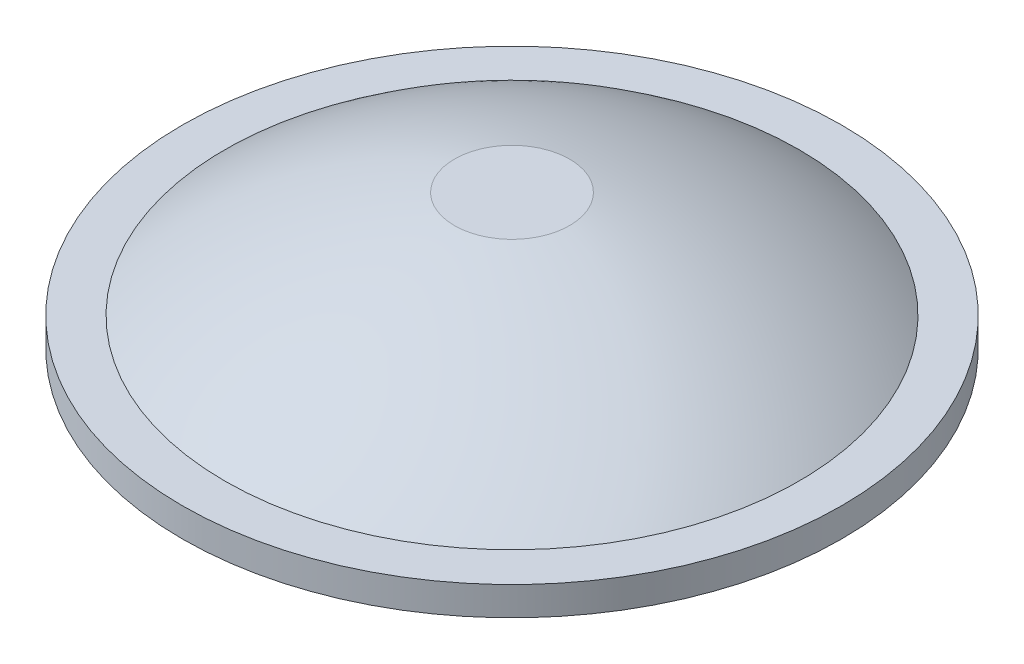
ISO-10303-21;
HEADER;
FILE_DESCRIPTION(('STEP AP214'),'2;1');
FILE_NAME('part.step','',(''),(''),'','','');
FILE_SCHEMA(('AUTOMOTIVE_DESIGN { 1 0 10303 214 1 1 1 1 }'));
ENDSEC;
DATA;
#1=APPLICATION_CONTEXT('core data for automotive mechanical design processes');
#2=APPLICATION_PROTOCOL_DEFINITION('international standard','automotive_design',2000,#1);
#3=PRODUCT_CONTEXT('',#1,'mechanical');
#4=PRODUCT('Part','Part','',(#3));
#5=PRODUCT_RELATED_PRODUCT_CATEGORY('part','',(#4));
#6=PRODUCT_DEFINITION_FORMATION('','',#4);
#7=PRODUCT_DEFINITION_CONTEXT('part definition',#1,'design');
#8=PRODUCT_DEFINITION('design','',#6,#7);
#9=PRODUCT_DEFINITION_SHAPE('','',#8);
#10=(LENGTH_UNIT() NAMED_UNIT(*) SI_UNIT(.MILLI.,.METRE.));
#11=(NAMED_UNIT(*) PLANE_ANGLE_UNIT() SI_UNIT($,.RADIAN.));
#12=(NAMED_UNIT(*) SI_UNIT($,.STERADIAN.) SOLID_ANGLE_UNIT());
#13=UNCERTAINTY_MEASURE_WITH_UNIT(LENGTH_MEASURE(1.E-05),#10,'distance_accuracy_value','');
#14=(GEOMETRIC_REPRESENTATION_CONTEXT(3) GLOBAL_UNCERTAINTY_ASSIGNED_CONTEXT((#13)) GLOBAL_UNIT_ASSIGNED_CONTEXT((#10,
#11,#12)) REPRESENTATION_CONTEXT('',''));
#15=CARTESIAN_POINT('',(0.,0.,0.));
#16=DIRECTION('',(0.,0.,1.));
#17=DIRECTION('',(1.,0.,0.));
#18=AXIS2_PLACEMENT_3D('',#15,#16,#17);
#19=CARTESIAN_POINT('',(0.,23.495,0.));
#20=DIRECTION('',(0.,-1.,0.));
#21=DIRECTION('',(0.,0.,-1.));
#22=AXIS2_PLACEMENT_3D('',#19,#20,#21);
#23=PLANE('',#22);
#24=CARTESIAN_POINT('',(0.,23.495,0.));
#25=DIRECTION('',(0.,1.,0.));
#26=DIRECTION('',(0.,0.,1.));
#27=AXIS2_PLACEMENT_3D('',#24,#25,#26);
#28=CIRCLE('',#27,12.3625899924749);
#29=CARTESIAN_POINT('',(0.,23.495,12.3625899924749));
#30=VERTEX_POINT('',#29);
#31=EDGE_CURVE('E10',#30,#30,#28,.T.);
#32=ORIENTED_EDGE('',*,*,#31,.F.);
#33=EDGE_LOOP('',(#32));
#34=FACE_BOUND('',#33,.T.);
#35=ADVANCED_FACE('F30',(#34),#23,.T.);
#36=CARTESIAN_POINT('',(0.,-96.0266034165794,0.));
#37=DIRECTION('',(0.,1.,0.));
#38=DIRECTION('',(0.,0.,1.));
#39=AXIS2_PLACEMENT_3D('',#36,#37,#38);
#40=DEGENERATE_TOROIDAL_SURFACE('',#39,13.5023620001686,122.288222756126,.F.);
#41=ORIENTED_EDGE('',*,*,#31,.T.);
#42=EDGE_LOOP('',(#41));
#43=FACE_BOUND('',#42,.T.);
#44=CARTESIAN_POINT('',(0.,0.,0.));
#45=DIRECTION('',(0.,1.,0.));
#46=DIRECTION('',(0.,0.,1.));
#47=AXIS2_PLACEMENT_3D('',#44,#45,#46);
#48=CIRCLE('',#47,62.2162015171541);
#49=CARTESIAN_POINT('',(0.,0.,62.2162015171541));
#50=VERTEX_POINT('',#49);
#51=EDGE_CURVE('E36',#50,#50,#48,.T.);
#52=ORIENTED_EDGE('',*,*,#51,.F.);
#53=EDGE_LOOP('',(#52));
#54=FACE_BOUND('',#53,.T.);
#55=ADVANCED_FACE('F91',(#43,#54),#40,.T.);
#56=CARTESIAN_POINT('',(0.,96.0266034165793,0.));
#57=DIRECTION('',(0.,1.,0.));
#58=DIRECTION('',(0.,0.,1.));
#59=AXIS2_PLACEMENT_3D('',#56,#57,#58);
#60=DEGENERATE_TOROIDAL_SURFACE('',#59,13.5023620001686,122.288222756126,.F.);
#61=ORIENTED_EDGE('',*,*,#51,.T.);
#62=EDGE_LOOP('',(#61));
#63=FACE_BOUND('',#62,.T.);
#64=CARTESIAN_POINT('',(0.,-23.495,0.));
#65=DIRECTION('',(0.,1.,0.));
#66=DIRECTION('',(0.,0.,1.));
#67=AXIS2_PLACEMENT_3D('',#64,#65,#66);
#68=CIRCLE('',#67,12.3625899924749);
#69=CARTESIAN_POINT('',(0.,-23.495,12.3625899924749));
#70=VERTEX_POINT('',#69);
#71=EDGE_CURVE('E40',#70,#70,#68,.T.);
#72=ORIENTED_EDGE('',*,*,#71,.F.);
#73=EDGE_LOOP('',(#72));
#74=FACE_BOUND('',#73,.T.);
#75=ADVANCED_FACE('F86',(#63,#74),#60,.T.);
#76=CARTESIAN_POINT('',(0.,-23.495,0.));
#77=DIRECTION('',(0.,1.,0.));
#78=DIRECTION('',(0.,0.,1.));
#79=AXIS2_PLACEMENT_3D('',#76,#77,#78);
#80=PLANE('',#79);
#81=CARTESIAN_POINT('',(0.,-23.495,0.));
#82=DIRECTION('',(0.,1.,0.));
#83=DIRECTION('',(0.,0.,1.));
#84=AXIS2_PLACEMENT_3D('',#81,#82,#83);
#85=CIRCLE('',#84,5.5499);
#86=CARTESIAN_POINT('',(0.,-23.495,5.5499));
#87=VERTEX_POINT('',#86);
#88=EDGE_CURVE('E67',#87,#87,#85,.F.);
#89=ORIENTED_EDGE('',*,*,#88,.T.);
#90=EDGE_LOOP('',(#89));
#91=FACE_BOUND('',#90,.T.);
#92=ORIENTED_EDGE('',*,*,#71,.T.);
#93=EDGE_LOOP('',(#92));
#94=FACE_BOUND('',#93,.T.);
#95=ADVANCED_FACE('F71',(#91,#94),#80,.T.);
#96=CARTESIAN_POINT('',(0.,-26.671,0.));
#97=DIRECTION('',(0.,1.,0.));
#98=DIRECTION('',(0.,0.,1.));
#99=AXIS2_PLACEMENT_3D('',#96,#97,#98);
#100=CYLINDRICAL_SURFACE('',#99,5.5499);
#101=CARTESIAN_POINT('',(0.,-26.67,0.));
#102=DIRECTION('',(0.,-1.,0.));
#103=DIRECTION('',(0.,0.,-1.));
#104=AXIS2_PLACEMENT_3D('',#101,#102,#103);
#105=CIRCLE('',#104,5.5499);
#106=CARTESIAN_POINT('',(0.,-26.67,-5.5499));
#107=VERTEX_POINT('',#106);
#108=EDGE_CURVE('E64',#107,#107,#105,.F.);
#109=ORIENTED_EDGE('',*,*,#108,.F.);
#110=EDGE_LOOP('',(#109));
#111=FACE_BOUND('',#110,.T.);
#112=ORIENTED_EDGE('',*,*,#88,.F.);
#113=EDGE_LOOP('',(#112));
#114=FACE_BOUND('',#113,.T.);
#115=ADVANCED_FACE('F74',(#111,#114),#100,.F.);
#116=CARTESIAN_POINT('',(0.,-26.67,0.));
#117=DIRECTION('',(0.,-1.,0.));
#118=DIRECTION('',(0.,0.,-1.));
#119=AXIS2_PLACEMENT_3D('',#116,#117,#118);
#120=PLANE('',#119);
#121=ORIENTED_EDGE('',*,*,#108,.T.);
#122=EDGE_LOOP('',(#121));
#123=FACE_BOUND('',#122,.T.);
#124=CARTESIAN_POINT('',(0.,-26.67,0.));
#125=DIRECTION('',(0.,1.,0.));
#126=DIRECTION('',(0.,0.,1.));
#127=AXIS2_PLACEMENT_3D('',#124,#125,#126);
#128=CIRCLE('',#127,12.7000000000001);
#129=CARTESIAN_POINT('',(0.,-26.67,12.7000000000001));
#130=VERTEX_POINT('',#129);
#131=EDGE_CURVE('E44',#130,#130,#128,.T.);
#132=ORIENTED_EDGE('',*,*,#131,.F.);
#133=EDGE_LOOP('',(#132));
#134=FACE_BOUND('',#133,.T.);
#135=ADVANCED_FACE('F76',(#123,#134),#120,.T.);
#136=CARTESIAN_POINT('',(0.,96.0266034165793,0.));
#137=DIRECTION('',(0.,1.,0.));
#138=DIRECTION('',(0.,0.,1.));
#139=AXIS2_PLACEMENT_3D('',#136,#137,#138);
#140=DEGENERATE_TOROIDAL_SURFACE('',#139,13.5023620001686,125.463222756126,.F.);
#141=ORIENTED_EDGE('',*,*,#131,.T.);
#142=EDGE_LOOP('',(#141));
#143=FACE_BOUND('',#142,.T.);
#144=CARTESIAN_POINT('',(0.,-3.175,0.));
#145=DIRECTION('',(0.,1.,0.));
#146=DIRECTION('',(0.,0.,1.));
#147=AXIS2_PLACEMENT_3D('',#144,#145,#146);
#148=CIRCLE('',#147,63.3095);
#149=CARTESIAN_POINT('',(0.,-3.175,63.3095));
#150=VERTEX_POINT('',#149);
#151=EDGE_CURVE('E49',#150,#150,#148,.T.);
#152=ORIENTED_EDGE('',*,*,#151,.F.);
#153=EDGE_LOOP('',(#152));
#154=FACE_BOUND('',#153,.T.);
#155=ADVANCED_FACE('F83',(#143,#154),#140,.F.);
#156=CARTESIAN_POINT('',(-63.3095,-3.17500000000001,0.));
#157=DIRECTION('',(0.,-1.,0.));
#158=DIRECTION('',(0.,0.,-1.));
#159=AXIS2_PLACEMENT_3D('',#156,#157,#158);
#160=PLANE('',#159);
#161=ORIENTED_EDGE('',*,*,#151,.T.);
#162=EDGE_LOOP('',(#161));
#163=FACE_BOUND('',#162,.T.);
#164=CARTESIAN_POINT('',(0.,-3.17500000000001,0.));
#165=DIRECTION('',(0.,1.,0.));
#166=DIRECTION('',(0.,0.,1.));
#167=AXIS2_PLACEMENT_3D('',#164,#165,#166);
#168=CIRCLE('',#167,72.7075);
#169=CARTESIAN_POINT('',(0.,-3.17500000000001,72.7075));
#170=VERTEX_POINT('',#169);
#171=EDGE_CURVE('E52',#170,#170,#168,.T.);
#172=ORIENTED_EDGE('',*,*,#171,.F.);
#173=EDGE_LOOP('',(#172));
#174=FACE_BOUND('',#173,.T.);
#175=ADVANCED_FACE('F104',(#163,#174),#160,.T.);
#176=CARTESIAN_POINT('',(0.,10.16,0.));
#177=DIRECTION('',(0.,1.,0.));
#178=DIRECTION('',(0.,0.,1.));
#179=AXIS2_PLACEMENT_3D('',#176,#177,#178);
#180=CYLINDRICAL_SURFACE('',#179,72.7075);
#181=ORIENTED_EDGE('',*,*,#171,.T.);
#182=EDGE_LOOP('',(#181));
#183=FACE_BOUND('',#182,.T.);
#184=CARTESIAN_POINT('',(0.,3.17499999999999,0.));
#185=DIRECTION('',(0.,1.,0.));
#186=DIRECTION('',(0.,0.,1.));
#187=AXIS2_PLACEMENT_3D('',#184,#185,#186);
#188=CIRCLE('',#187,72.7075);
#189=CARTESIAN_POINT('',(0.,3.17499999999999,72.7075));
#190=VERTEX_POINT('',#189);
#191=EDGE_CURVE('E55',#190,#190,#188,.T.);
#192=ORIENTED_EDGE('',*,*,#191,.F.);
#193=EDGE_LOOP('',(#192));
#194=FACE_BOUND('',#193,.T.);
#195=ADVANCED_FACE('F108',(#183,#194),#180,.T.);
#196=CARTESIAN_POINT('',(-63.3095,3.17499999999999,0.));
#197=DIRECTION('',(0.,1.,0.));
#198=DIRECTION('',(0.,0.,1.));
#199=AXIS2_PLACEMENT_3D('',#196,#197,#198);
#200=PLANE('',#199);
#201=ORIENTED_EDGE('',*,*,#191,.T.);
#202=EDGE_LOOP('',(#201));
#203=FACE_BOUND('',#202,.T.);
#204=CARTESIAN_POINT('',(0.,3.17499999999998,0.));
#205=DIRECTION('',(0.,1.,0.));
#206=DIRECTION('',(0.,0.,1.));
#207=AXIS2_PLACEMENT_3D('',#204,#205,#206);
#208=CIRCLE('',#207,63.3095);
#209=CARTESIAN_POINT('',(0.,3.17499999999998,63.3095));
#210=VERTEX_POINT('',#209);
#211=EDGE_CURVE('E58',#210,#210,#208,.T.);
#212=ORIENTED_EDGE('',*,*,#211,.F.);
#213=EDGE_LOOP('',(#212));
#214=FACE_BOUND('',#213,.T.);
#215=ADVANCED_FACE('F112',(#203,#214),#200,.T.);
#216=CARTESIAN_POINT('',(0.,-96.0266034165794,0.));
#217=DIRECTION('',(0.,1.,0.));
#218=DIRECTION('',(0.,0.,1.));
#219=AXIS2_PLACEMENT_3D('',#216,#217,#218);
#220=DEGENERATE_TOROIDAL_SURFACE('',#219,13.5023620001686,125.463222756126,.F.);
#221=ORIENTED_EDGE('',*,*,#211,.T.);
#222=EDGE_LOOP('',(#221));
#223=FACE_BOUND('',#222,.T.);
#224=CARTESIAN_POINT('',(0.,26.67,0.));
#225=DIRECTION('',(0.,1.,0.));
#226=DIRECTION('',(0.,0.,1.));
#227=AXIS2_PLACEMENT_3D('',#224,#225,#226);
#228=CIRCLE('',#227,12.7);
#229=CARTESIAN_POINT('',(0.,26.67,12.7));
#230=VERTEX_POINT('',#229);
#231=EDGE_CURVE('E61',#230,#230,#228,.T.);
#232=ORIENTED_EDGE('',*,*,#231,.F.);
#233=EDGE_LOOP('',(#232));
#234=FACE_BOUND('',#233,.T.);
#235=ADVANCED_FACE('F116',(#223,#234),#220,.F.);
#236=CARTESIAN_POINT('',(0.,26.67,0.));
#237=DIRECTION('',(0.,1.,0.));
#238=DIRECTION('',(0.,0.,1.));
#239=AXIS2_PLACEMENT_3D('',#236,#237,#238);
#240=PLANE('',#239);
#241=ORIENTED_EDGE('',*,*,#231,.T.);
#242=EDGE_LOOP('',(#241));
#243=FACE_BOUND('',#242,.T.);
#244=ADVANCED_FACE('F119',(#243),#240,.T.);
#245=CLOSED_SHELL('',(#35,#55,#75,#95,#115,#135,#155,#175,#195,#215,#235,#244));
#246=MANIFOLD_SOLID_BREP('B2',#245);
#247=ADVANCED_BREP_SHAPE_REPRESENTATION('',(#18,#246),#14);
#248=SHAPE_DEFINITION_REPRESENTATION(#9,#247);
ENDSEC;
END-ISO-10303-21;
